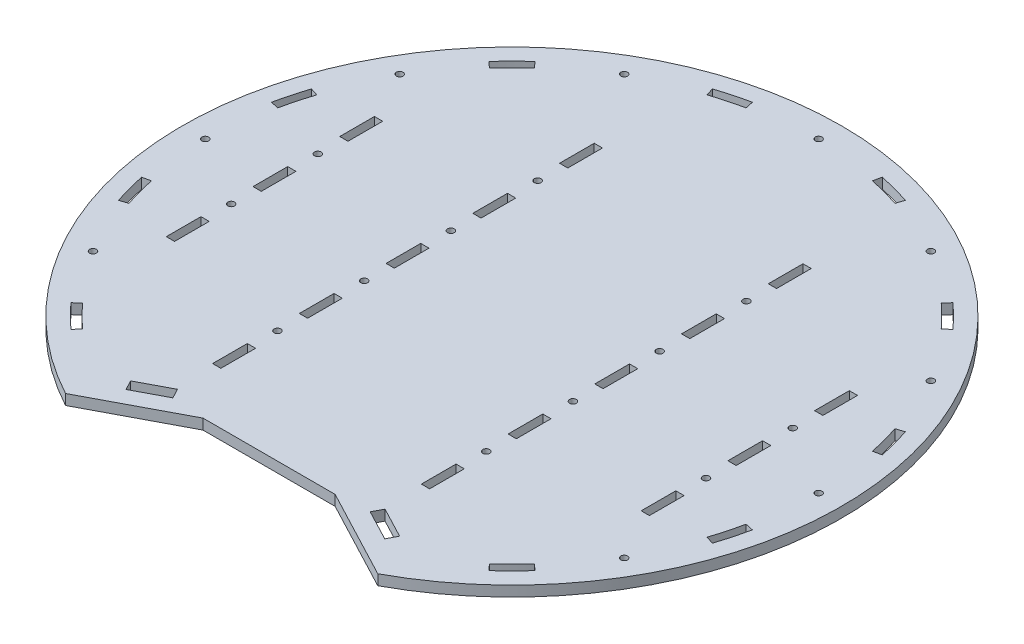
from build123d import *

# Parameters (mm, degrees)
SKETCH1_R           = 1.9558
SKETCH1_W           = 4.76
SKETCH1_H           = 20
BOSS_EXTRUDE1_DEPTH = 6


with BuildPart() as part:
    # Sketch1 → Boss-Extrude1 (new body)
    with BuildSketch(Plane(origin=(0, 0, 0), x_dir=(1, 0, 0), z_dir=(0, 1, 0))):
        with BuildLine():
            Line((-90, -167.332005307), (-38.1, -140))
            Line((-38.1, -140), (38.1, -140))
            Line((38.1, -140), (90, -167.332005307))
            ThreePointArc((90, -167.332005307), (0, 190), (-90, -167.332005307))
        make_face()
        with Locations(Location((-136.88, 25, 0), (0, 0, 270))):
            Circle(SKETCH1_R, mode=Mode.SUBTRACT)
        with Locations(Location((-136.88, -25, 0), (0, 0, 270))):
            Circle(SKETCH1_R, mode=Mode.SUBTRACT)
        with Locations(Location((-60.173328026, -25, 0), (0, 0, 270))):
            Circle(SKETCH1_R, mode=Mode.SUBTRACT)
        with Locations(Location((-60.173328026, -75, 0), (0, 0, 270))):
            Circle(SKETCH1_R, mode=Mode.SUBTRACT)
        with Locations(Location((-60.173328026, 25, 0), (0, 0, 270))):
            Circle(SKETCH1_R, mode=Mode.SUBTRACT)
        with Locations(Location((-60.173328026, 75, 0), (0, 0, 270))):
            Circle(SKETCH1_R, mode=Mode.SUBTRACT)
        with Locations(Location((0, 176.805718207, 0), (0, 0, 270))):
            Circle(SKETCH1_R, mode=Mode.SUBTRACT)
        with Locations(Location((-88.402859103, 153.118243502, 0), (0, 0, 270))):
            Circle(SKETCH1_R, mode=Mode.SUBTRACT)
        with Locations(Location((-153.118243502, 88.402859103, 0), (0, 0, 270))):
            Circle(SKETCH1_R, mode=Mode.SUBTRACT)
        with Locations(Location((-176.805718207, 0, 0), (0, 0, 270))):
            Circle(SKETCH1_R, mode=Mode.SUBTRACT)
        with Locations(Location((-153.118243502, -88.402859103, 0), (0, 0, 270))):
            Circle(SKETCH1_R, mode=Mode.SUBTRACT)
        with Locations(Location((88.402859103, 153.118243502, 0), (0, 0, 270))):
            Circle(SKETCH1_R, mode=Mode.SUBTRACT)
        with Locations(Location((60.173328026, -75, 0), (0, 0, 270))):
            Circle(SKETCH1_R, mode=Mode.SUBTRACT)
        with Locations(Location((153.118243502, -88.402859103, 0), (0, 0, 270))):
            Circle(SKETCH1_R, mode=Mode.SUBTRACT)
        with Locations(Location((176.805718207, 0, 0), (0, 0, 270))):
            Circle(SKETCH1_R, mode=Mode.SUBTRACT)
        with Locations(Location((153.118243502, 88.402859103, 0), (0, 0, 270))):
            Circle(SKETCH1_R, mode=Mode.SUBTRACT)
        with Locations(Location((136.88, -25, 0), (0, 0, 270))):
            Circle(SKETCH1_R, mode=Mode.SUBTRACT)
        with Locations(Location((60.173328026, -25, 0), (0, 0, 270))):
            Circle(SKETCH1_R, mode=Mode.SUBTRACT)
        with Locations(Location((60.173328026, 25, 0), (0, 0, 270))):
            Circle(SKETCH1_R, mode=Mode.SUBTRACT)
        with Locations(Location((136.88, 25, 0), (0, 0, 270))):
            Circle(SKETCH1_R, mode=Mode.SUBTRACT)
        with Locations(Location((60.173328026, 75, 0), (0, 0, 270))):
            Circle(SKETCH1_R, mode=Mode.SUBTRACT)
        with Locations((136.88, -50)):
            Rectangle(SKETCH1_W, SKETCH1_H, mode=Mode.SUBTRACT)
        with Locations((-136.88, 50)):
            Rectangle(SKETCH1_W, SKETCH1_H, mode=Mode.SUBTRACT)
        with Locations((-136.88, 0)):
            Rectangle(SKETCH1_W, SKETCH1_H, mode=Mode.SUBTRACT)
        with Locations((-136.88, -50)):
            Rectangle(SKETCH1_W, SKETCH1_H, mode=Mode.SUBTRACT)
        with Locations((136.88, 0)):
            Rectangle(SKETCH1_W, SKETCH1_H, mode=Mode.SUBTRACT)
        with Locations((136.88, 50)):
            Rectangle(SKETCH1_W, SKETCH1_H, mode=Mode.SUBTRACT)
        with BuildLine():
            Line((-54.152138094, 166.663143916), (-55.623058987, 171.190172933))
            ThreePointArc((-55.623058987, 171.190172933), (-46.587428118, 173.866648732), (-37.424104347, 176.066568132))
            Line((-37.424104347, 176.066568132), (-36.434444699, 171.410585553))
            ThreePointArc((-36.434444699, 171.410585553), (-45.355449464, 169.268841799), (-54.152138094, 166.663143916))
        make_face(mode=Mode.SUBTRACT)
        with BuildLine():
            Line((-120.443509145, 133.766068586), (-117.258447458, 130.228699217))
            ThreePointArc((-117.258447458, 130.228699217), (-123.913392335, 123.913392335), (-130.228699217, 117.258447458))
            Line((-130.228699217, 117.258447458), (-133.766068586, 120.443509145))
            ThreePointArc((-133.766068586, 120.443509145), (-127.279220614, 127.279220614), (-120.443509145, 133.766068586))
        make_face(mode=Mode.SUBTRACT)
        with BuildLine():
            Line((-171.190172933, 55.623058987), (-166.663143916, 54.152138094))
            ThreePointArc((-166.663143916, 54.152138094), (-169.268841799, 45.355449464), (-171.410585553, 36.434444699))
            Line((-171.410585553, 36.434444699), (-176.066568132, 37.424104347))
            ThreePointArc((-176.066568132, 37.424104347), (-173.866648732, 46.587428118), (-171.190172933, 55.623058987))
        make_face(mode=Mode.SUBTRACT)
        with BuildLine():
            Line((-176.066568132, -37.424104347), (-171.410585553, -36.434444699))
            ThreePointArc((-171.410585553, -36.434444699), (-169.268841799, -45.355449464), (-166.663143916, -54.152138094))
            Line((-166.663143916, -54.152138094), (-171.190172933, -55.623058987))
            ThreePointArc((-171.190172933, -55.623058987), (-173.866648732, -46.587428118), (-176.066568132, -37.424104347))
        make_face(mode=Mode.SUBTRACT)
        with BuildLine():
            Line((-133.766068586, -120.443509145), (-130.228699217, -117.258447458))
            ThreePointArc((-130.228699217, -117.258447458), (-123.913392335, -123.913392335), (-117.258447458, -130.228699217))
            Line((-117.258447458, -130.228699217), (-120.443509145, -133.766068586))
            ThreePointArc((-120.443509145, -133.766068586), (-127.279220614, -127.279220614), (-133.766068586, -120.443509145))
        make_face(mode=Mode.SUBTRACT)
        with Locations((60.173328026, 0)):
            Rectangle(SKETCH1_W, SKETCH1_H, mode=Mode.SUBTRACT)
        with BuildLine():
            Line((117.258447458, -130.228699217), (120.443509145, -133.766068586))
            ThreePointArc((120.443509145, -133.766068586), (127.279220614, -127.279220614), (133.766068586, -120.443509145))
            Line((133.766068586, -120.443509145), (130.228699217, -117.258447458))
            ThreePointArc((130.228699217, -117.258447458), (123.913392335, -123.913392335), (117.258447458, -130.228699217))
        make_face(mode=Mode.SUBTRACT)
        with BuildLine():
            Line((166.663143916, -54.152138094), (171.190172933, -55.623058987))
            ThreePointArc((171.190172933, -55.623058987), (173.866648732, -46.587428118), (176.066568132, -37.424104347))
            Line((176.066568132, -37.424104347), (171.410585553, -36.434444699))
            ThreePointArc((171.410585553, -36.434444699), (169.268841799, -45.355449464), (166.663143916, -54.152138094))
        make_face(mode=Mode.SUBTRACT)
        with BuildLine():
            Line((171.410585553, 36.434444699), (176.066568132, 37.424104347))
            ThreePointArc((176.066568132, 37.424104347), (173.866648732, 46.587428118), (171.190172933, 55.623058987))
            Line((171.190172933, 55.623058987), (166.663143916, 54.152138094))
            ThreePointArc((166.663143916, 54.152138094), (169.268841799, 45.355449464), (171.410585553, 36.434444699))
        make_face(mode=Mode.SUBTRACT)
        with BuildLine():
            Line((130.228699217, 117.258447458), (133.766068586, 120.443509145))
            ThreePointArc((133.766068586, 120.443509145), (127.279220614, 127.279220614), (120.443509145, 133.766068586))
            Line((120.443509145, 133.766068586), (117.258447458, 130.228699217))
            ThreePointArc((117.258447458, 130.228699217), (123.913392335, 123.913392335), (130.228699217, 117.258447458))
        make_face(mode=Mode.SUBTRACT)
        with BuildLine():
            Line((37.424104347, 176.066568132), (36.434444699, 171.410585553))
            ThreePointArc((36.434444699, 171.410585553), (45.355449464, 169.268841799), (54.152138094, 166.663143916))
            Line((54.152138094, 166.663143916), (55.623058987, 171.190172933))
            ThreePointArc((55.623058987, 171.190172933), (46.587428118, 173.866648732), (37.424104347, 176.066568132))
        make_face(mode=Mode.SUBTRACT)
        Polygon((-56.879281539, -138.587765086), (-59.838145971, -132.969258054), (-77.534231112, -142.288516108), (-74.57536668, -147.90702314), align=None, mode=Mode.SUBTRACT)
        Polygon((77.534231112, -142.288516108), (74.57536668, -147.90702314), (56.879281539, -138.587765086), (59.838145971, -132.969258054), align=None, mode=Mode.SUBTRACT)
        with Locations((-60.173328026, 50)):
            Rectangle(SKETCH1_W, SKETCH1_H, mode=Mode.SUBTRACT)
        with Locations((-60.173328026, 0)):
            Rectangle(SKETCH1_W, SKETCH1_H, mode=Mode.SUBTRACT)
        with Locations((-60.173328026, 100)):
            Rectangle(SKETCH1_W, SKETCH1_H, mode=Mode.SUBTRACT)
        with Locations((-60.173328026, -50)):
            Rectangle(SKETCH1_W, SKETCH1_H, mode=Mode.SUBTRACT)
        with Locations((-60.173328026, -100)):
            Rectangle(SKETCH1_W, SKETCH1_H, mode=Mode.SUBTRACT)
        with Locations((60.173328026, -50)):
            Rectangle(SKETCH1_W, SKETCH1_H, mode=Mode.SUBTRACT)
        with Locations((60.173328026, -100)):
            Rectangle(SKETCH1_W, SKETCH1_H, mode=Mode.SUBTRACT)
        with Locations((60.173328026, 100)):
            Rectangle(SKETCH1_W, SKETCH1_H, mode=Mode.SUBTRACT)
        with Locations((60.173328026, 50)):
            Rectangle(SKETCH1_W, SKETCH1_H, mode=Mode.SUBTRACT)
    extrude(amount=BOSS_EXTRUDE1_DEPTH)


solid = part.part
